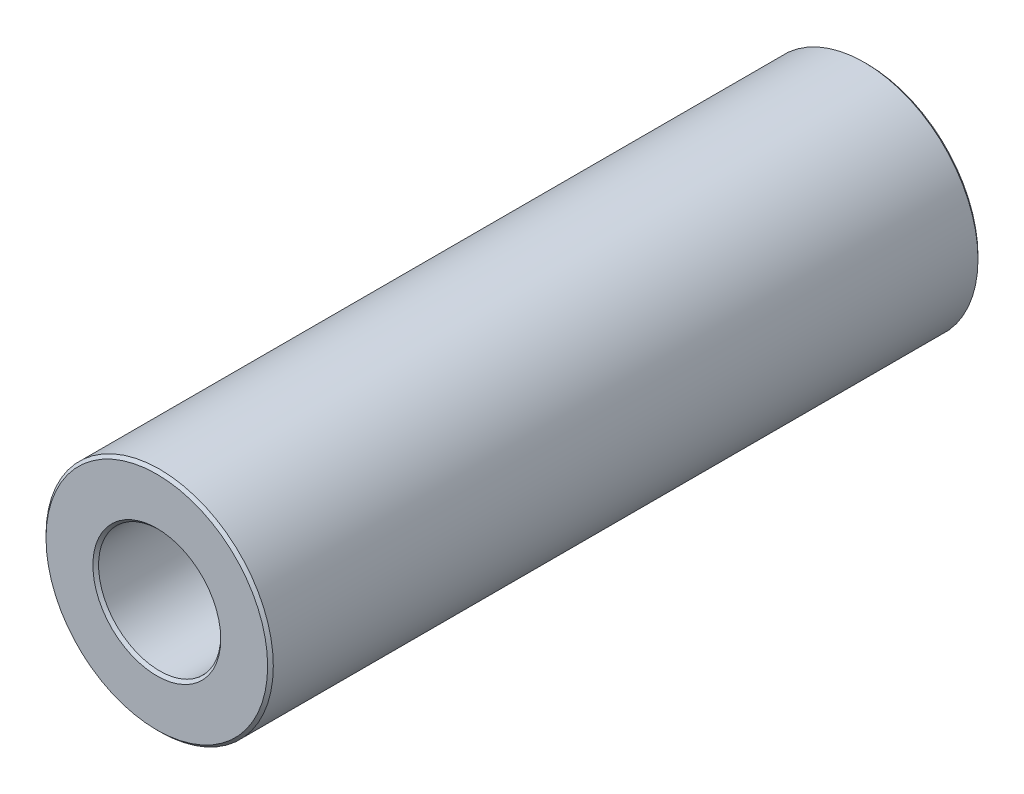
from build123d import *

# Parameters (mm, degrees)
SKETCH1_R           = 4
SKETCH1_R_2         = 2.15
BOSS_EXTRUDE2_DEPTH = 12.5
CHAMFER3_SIZE       = 0.1


with BuildPart() as part:
    # Sketch1 → Boss-Extrude2 (new, symmetric)
    with BuildSketch(Plane.XY):
        Circle(SKETCH1_R)
        Circle(SKETCH1_R_2, mode=Mode.SUBTRACT)
    extrude(amount=BOSS_EXTRUDE2_DEPTH, both=True)

    # Chamfer3
    chamfer3_edges = [part.edges().sort_by_distance(p)[0] for p in [
        (-4, 0, -12.5),
        (-4, 0, 12.5),
        (-2.15, 0, -12.5),
        (-2.15, 0, 12.5),
    ]]
    chamfer(chamfer3_edges, length=CHAMFER3_SIZE)


solid = part.part
